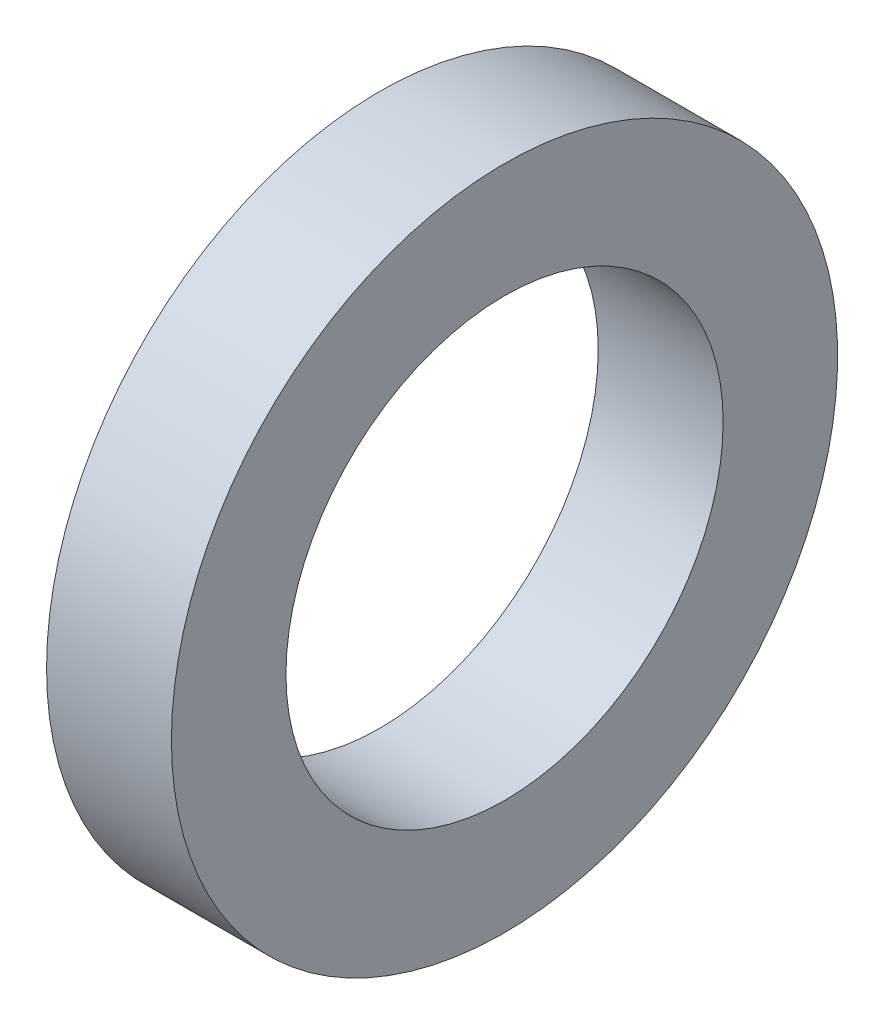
from build123d import *

# Parameters (mm, degrees)
ESQUISSE1_W = 3
ESQUISSE1_H = 2.75


with BuildPart() as part:
    # Esquisse1 → Base-R_volution (revolve)
    with BuildSketch(Plane(origin=(0, 0, 0), x_dir=(1, 0, 0), z_dir=(0, 1, 0)), mode=Mode.PRIVATE) as base_r_volution_sk:
        with Locations((1.5, 6.625)):
            Rectangle(ESQUISSE1_W, ESQUISSE1_H)
    revolve(base_r_volution_sk.sketch.rotate(Axis((0, 0, 0), (1, 0, 0)), 180), axis=Axis((0, 0, 0), (1, 0, 0)))


solid = part.part
